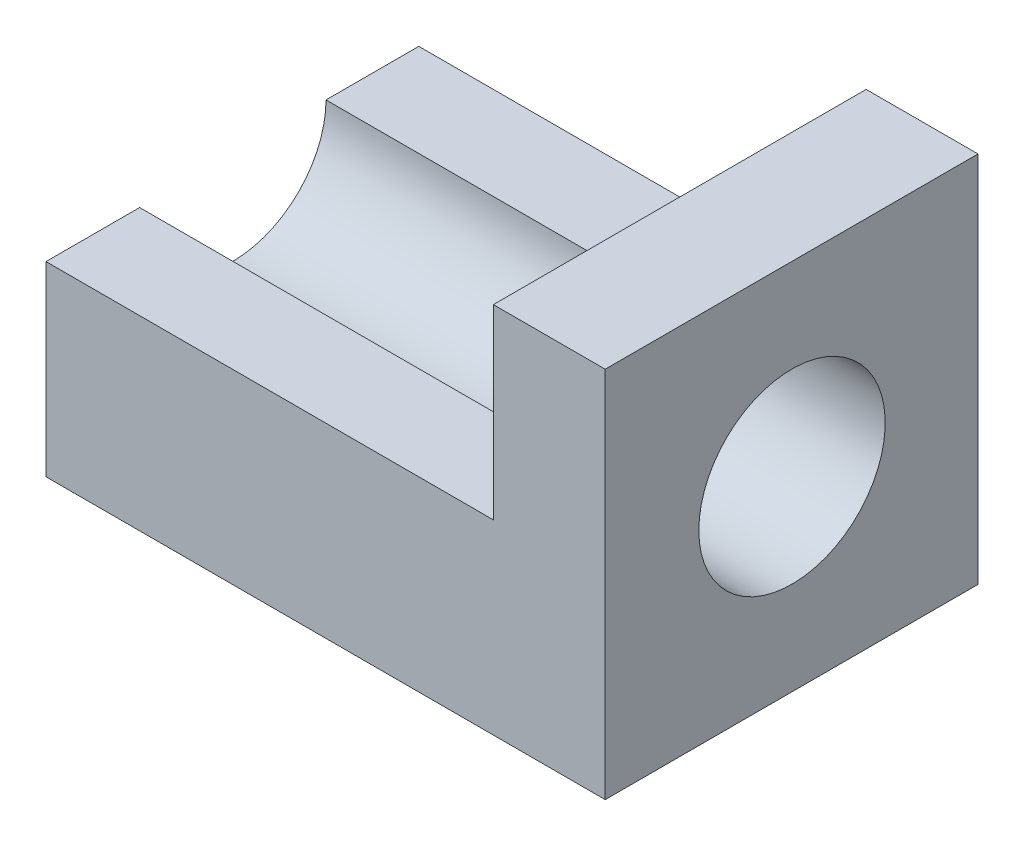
ISO-10303-21;
HEADER;
FILE_DESCRIPTION(('STEP AP214'),'2;1');
FILE_NAME('part.step','',(''),(''),'','','');
FILE_SCHEMA(('AUTOMOTIVE_DESIGN { 1 0 10303 214 1 1 1 1 }'));
ENDSEC;
DATA;
#1=APPLICATION_CONTEXT('core data for automotive mechanical design processes');
#2=APPLICATION_PROTOCOL_DEFINITION('international standard','automotive_design',2000,#1);
#3=PRODUCT_CONTEXT('',#1,'mechanical');
#4=PRODUCT('Part','Part','',(#3));
#5=PRODUCT_RELATED_PRODUCT_CATEGORY('part','',(#4));
#6=PRODUCT_DEFINITION_FORMATION('','',#4);
#7=PRODUCT_DEFINITION_CONTEXT('part definition',#1,'design');
#8=PRODUCT_DEFINITION('design','',#6,#7);
#9=PRODUCT_DEFINITION_SHAPE('','',#8);
#10=(LENGTH_UNIT() NAMED_UNIT(*) SI_UNIT(.MILLI.,.METRE.));
#11=(NAMED_UNIT(*) PLANE_ANGLE_UNIT() SI_UNIT($,.RADIAN.));
#12=(NAMED_UNIT(*) SI_UNIT($,.STERADIAN.) SOLID_ANGLE_UNIT());
#13=UNCERTAINTY_MEASURE_WITH_UNIT(LENGTH_MEASURE(1.E-05),#10,'distance_accuracy_value','');
#14=(GEOMETRIC_REPRESENTATION_CONTEXT(3) GLOBAL_UNCERTAINTY_ASSIGNED_CONTEXT((#13)) GLOBAL_UNIT_ASSIGNED_CONTEXT((#10,
#11,#12)) REPRESENTATION_CONTEXT('',''));
#15=CARTESIAN_POINT('',(0.,0.,0.));
#16=DIRECTION('',(0.,0.,1.));
#17=DIRECTION('',(1.,0.,0.));
#18=AXIS2_PLACEMENT_3D('',#15,#16,#17);
#19=CARTESIAN_POINT('',(150.,50.,-50.));
#20=DIRECTION('',(0.,-1.,0.));
#21=DIRECTION('',(0.,0.,-1.));
#22=AXIS2_PLACEMENT_3D('',#19,#20,#21);
#23=PLANE('',#22);
#24=DIRECTION('',(0.,0.,-1.));
#25=VECTOR('',#24,1.);
#26=CARTESIAN_POINT('',(120.,50.,-25.1109195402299));
#27=LINE('',#26,#25);
#28=CARTESIAN_POINT('',(120.,50.,-25.1109195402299));
#29=VERTEX_POINT('',#28);
#30=CARTESIAN_POINT('',(120.,50.,-50.));
#31=VERTEX_POINT('',#30);
#32=EDGE_CURVE('E133',#29,#31,#27,.T.);
#33=ORIENTED_EDGE('',*,*,#32,.T.);
#34=DIRECTION('',(-1.,0.,0.));
#35=VECTOR('',#34,1.);
#36=CARTESIAN_POINT('',(150.,50.,-50.));
#37=LINE('',#36,#35);
#38=CARTESIAN_POINT('',(0.,50.,-50.));
#39=VERTEX_POINT('',#38);
#40=EDGE_CURVE('E118',#31,#39,#37,.T.);
#41=ORIENTED_EDGE('',*,*,#40,.T.);
#42=DIRECTION('',(0.,0.,1.));
#43=VECTOR('',#42,1.);
#44=CARTESIAN_POINT('',(0.,50.,-50.));
#45=LINE('',#44,#43);
#46=CARTESIAN_POINT('',(0.,50.,-25.1109195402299));
#47=VERTEX_POINT('',#46);
#48=EDGE_CURVE('E111',#39,#47,#45,.T.);
#49=ORIENTED_EDGE('',*,*,#48,.T.);
#50=DIRECTION('',(-1.,0.,0.));
#51=VECTOR('',#50,1.);
#52=CARTESIAN_POINT('',(150.,50.,-25.1109195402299));
#53=LINE('',#52,#51);
#54=EDGE_CURVE('E116',#29,#47,#53,.T.);
#55=ORIENTED_EDGE('',*,*,#54,.F.);
#56=EDGE_LOOP('',(#33,#41,#49,#55));
#57=FACE_BOUND('',#56,.T.);
#58=ADVANCED_FACE('F31',(#57),#23,.F.);
#59=CARTESIAN_POINT('',(150.,50.,50.));
#60=DIRECTION('',(0.,-1.,0.));
#61=DIRECTION('',(0.,0.,-1.));
#62=AXIS2_PLACEMENT_3D('',#59,#60,#61);
#63=PLANE('',#62);
#64=DIRECTION('',(0.,0.,-1.));
#65=VECTOR('',#64,1.);
#66=CARTESIAN_POINT('',(120.,50.,50.));
#67=LINE('',#66,#65);
#68=CARTESIAN_POINT('',(120.,50.,50.));
#69=VERTEX_POINT('',#68);
#70=CARTESIAN_POINT('',(120.,50.,24.8890804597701));
#71=VERTEX_POINT('',#70);
#72=EDGE_CURVE('E201',#69,#71,#67,.T.);
#73=ORIENTED_EDGE('',*,*,#72,.T.);
#74=DIRECTION('',(-1.,0.,0.));
#75=VECTOR('',#74,1.);
#76=CARTESIAN_POINT('',(150.,50.,24.8890804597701));
#77=LINE('',#76,#75);
#78=CARTESIAN_POINT('',(0.,50.,24.8890804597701));
#79=VERTEX_POINT('',#78);
#80=EDGE_CURVE('E71',#71,#79,#77,.T.);
#81=ORIENTED_EDGE('',*,*,#80,.T.);
#82=DIRECTION('',(0.,0.,1.));
#83=VECTOR('',#82,1.);
#84=CARTESIAN_POINT('',(0.,50.,50.));
#85=LINE('',#84,#83);
#86=CARTESIAN_POINT('',(0.,50.,50.));
#87=VERTEX_POINT('',#86);
#88=EDGE_CURVE('E89',#79,#87,#85,.T.);
#89=ORIENTED_EDGE('',*,*,#88,.T.);
#90=DIRECTION('',(-1.,0.,0.));
#91=VECTOR('',#90,1.);
#92=CARTESIAN_POINT('',(150.,50.,50.));
#93=LINE('',#92,#91);
#94=EDGE_CURVE('E78',#69,#87,#93,.T.);
#95=ORIENTED_EDGE('',*,*,#94,.F.);
#96=EDGE_LOOP('',(#73,#81,#89,#95));
#97=FACE_BOUND('',#96,.T.);
#98=ADVANCED_FACE('F90',(#97),#63,.F.);
#99=CARTESIAN_POINT('',(150.,0.,50.));
#100=DIRECTION('',(0.,0.,-1.));
#101=DIRECTION('',(-1.,0.,0.));
#102=AXIS2_PLACEMENT_3D('',#99,#100,#101);
#103=PLANE('',#102);
#104=DIRECTION('',(0.,-1.,0.));
#105=VECTOR('',#104,1.);
#106=CARTESIAN_POINT('',(0.,0.,50.));
#107=LINE('',#106,#105);
#108=CARTESIAN_POINT('',(0.,0.,50.));
#109=VERTEX_POINT('',#108);
#110=EDGE_CURVE('E81',#87,#109,#107,.T.);
#111=ORIENTED_EDGE('',*,*,#110,.T.);
#112=DIRECTION('',(-1.,0.,0.));
#113=VECTOR('',#112,1.);
#114=CARTESIAN_POINT('',(150.,0.,50.));
#115=LINE('',#114,#113);
#116=CARTESIAN_POINT('',(150.,0.,50.));
#117=VERTEX_POINT('',#116);
#118=EDGE_CURVE('E11',#117,#109,#115,.T.);
#119=ORIENTED_EDGE('',*,*,#118,.F.);
#120=DIRECTION('',(0.,-1.,0.));
#121=VECTOR('',#120,1.);
#122=CARTESIAN_POINT('',(150.,0.,50.));
#123=LINE('',#122,#121);
#124=CARTESIAN_POINT('',(150.,100.,50.));
#125=VERTEX_POINT('',#124);
#126=EDGE_CURVE('E93',#125,#117,#123,.T.);
#127=ORIENTED_EDGE('',*,*,#126,.F.);
#128=DIRECTION('',(1.,0.,0.));
#129=VECTOR('',#128,1.);
#130=CARTESIAN_POINT('',(120.,100.,50.));
#131=LINE('',#130,#129);
#132=CARTESIAN_POINT('',(120.,100.,50.));
#133=VERTEX_POINT('',#132);
#134=EDGE_CURVE('E99',#133,#125,#131,.T.);
#135=ORIENTED_EDGE('',*,*,#134,.F.);
#136=DIRECTION('',(0.,-1.,0.));
#137=VECTOR('',#136,1.);
#138=CARTESIAN_POINT('',(120.,50.,50.));
#139=LINE('',#138,#137);
#140=EDGE_CURVE('E85',#133,#69,#139,.T.);
#141=ORIENTED_EDGE('',*,*,#140,.T.);
#142=ORIENTED_EDGE('',*,*,#94,.T.);
#143=EDGE_LOOP('',(#111,#119,#127,#135,#141,#142));
#144=FACE_BOUND('',#143,.T.);
#145=ADVANCED_FACE('F33',(#144),#103,.F.);
#146=CARTESIAN_POINT('',(150.,0.,50.));
#147=DIRECTION('',(0.,1.,0.));
#148=DIRECTION('',(0.,0.,1.));
#149=AXIS2_PLACEMENT_3D('',#146,#147,#148);
#150=PLANE('',#149);
#151=DIRECTION('',(0.,0.,-1.));
#152=VECTOR('',#151,1.);
#153=CARTESIAN_POINT('',(0.,0.,50.));
#154=LINE('',#153,#152);
#155=CARTESIAN_POINT('',(0.,0.,-50.));
#156=VERTEX_POINT('',#155);
#157=EDGE_CURVE('E98',#109,#156,#154,.T.);
#158=ORIENTED_EDGE('',*,*,#157,.T.);
#159=DIRECTION('',(-1.,0.,0.));
#160=VECTOR('',#159,1.);
#161=CARTESIAN_POINT('',(150.,0.,-50.));
#162=LINE('',#161,#160);
#163=CARTESIAN_POINT('',(150.,0.,-50.));
#164=VERTEX_POINT('',#163);
#165=EDGE_CURVE('E40',#164,#156,#162,.T.);
#166=ORIENTED_EDGE('',*,*,#165,.F.);
#167=DIRECTION('',(0.,0.,-1.));
#168=VECTOR('',#167,1.);
#169=CARTESIAN_POINT('',(150.,0.,50.));
#170=LINE('',#169,#168);
#171=EDGE_CURVE('E48',#117,#164,#170,.T.);
#172=ORIENTED_EDGE('',*,*,#171,.F.);
#173=ORIENTED_EDGE('',*,*,#118,.T.);
#174=EDGE_LOOP('',(#158,#166,#172,#173));
#175=FACE_BOUND('',#174,.T.);
#176=ADVANCED_FACE('F170',(#175),#150,.F.);
#177=CARTESIAN_POINT('',(150.,0.,-50.));
#178=DIRECTION('',(0.,0.,1.));
#179=DIRECTION('',(1.,0.,0.));
#180=AXIS2_PLACEMENT_3D('',#177,#178,#179);
#181=PLANE('',#180);
#182=DIRECTION('',(0.,1.,0.));
#183=VECTOR('',#182,1.);
#184=CARTESIAN_POINT('',(0.,0.,-50.));
#185=LINE('',#184,#183);
#186=EDGE_CURVE('E101',#156,#39,#185,.T.);
#187=ORIENTED_EDGE('',*,*,#186,.T.);
#188=ORIENTED_EDGE('',*,*,#40,.F.);
#189=DIRECTION('',(0.,1.,0.));
#190=VECTOR('',#189,1.);
#191=CARTESIAN_POINT('',(120.,50.,-50.));
#192=LINE('',#191,#190);
#193=CARTESIAN_POINT('',(120.,100.,-50.));
#194=VERTEX_POINT('',#193);
#195=EDGE_CURVE('E137',#31,#194,#192,.T.);
#196=ORIENTED_EDGE('',*,*,#195,.T.);
#197=DIRECTION('',(1.,0.,0.));
#198=VECTOR('',#197,1.);
#199=CARTESIAN_POINT('',(120.,100.,-50.));
#200=LINE('',#199,#198);
#201=CARTESIAN_POINT('',(150.,100.,-50.));
#202=VERTEX_POINT('',#201);
#203=EDGE_CURVE('E104',#194,#202,#200,.T.);
#204=ORIENTED_EDGE('',*,*,#203,.T.);
#205=DIRECTION('',(0.,1.,0.));
#206=VECTOR('',#205,1.);
#207=CARTESIAN_POINT('',(150.,0.,-50.));
#208=LINE('',#207,#206);
#209=EDGE_CURVE('E126',#164,#202,#208,.T.);
#210=ORIENTED_EDGE('',*,*,#209,.F.);
#211=ORIENTED_EDGE('',*,*,#165,.T.);
#212=EDGE_LOOP('',(#187,#188,#196,#204,#210,#211));
#213=FACE_BOUND('',#212,.T.);
#214=ADVANCED_FACE('F122',(#213),#181,.F.);
#215=CARTESIAN_POINT('',(150.,50.,-0.110919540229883));
#216=DIRECTION('',(-1.,0.,0.));
#217=DIRECTION('',(0.,0.,1.));
#218=AXIS2_PLACEMENT_3D('',#215,#216,#217);
#219=CYLINDRICAL_SURFACE('',#218,25.);
#220=CARTESIAN_POINT('',(120.,50.,-0.110919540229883));
#221=DIRECTION('',(-1.,0.,0.));
#222=DIRECTION('',(0.,0.,-1.));
#223=AXIS2_PLACEMENT_3D('',#220,#221,#222);
#224=CIRCLE('',#223,25.);
#225=EDGE_CURVE('E161',#71,#29,#224,.T.);
#226=ORIENTED_EDGE('',*,*,#225,.T.);
#227=ORIENTED_EDGE('',*,*,#54,.T.);
#228=CARTESIAN_POINT('',(0.,50.,-0.110919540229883));
#229=DIRECTION('',(-1.,0.,0.));
#230=DIRECTION('',(0.,0.,1.));
#231=AXIS2_PLACEMENT_3D('',#228,#229,#230);
#232=CIRCLE('',#231,25.);
#233=EDGE_CURVE('E94',#47,#79,#232,.T.);
#234=ORIENTED_EDGE('',*,*,#233,.T.);
#235=ORIENTED_EDGE('',*,*,#80,.F.);
#236=EDGE_LOOP('',(#226,#227,#234,#235));
#237=FACE_BOUND('',#236,.T.);
#238=CARTESIAN_POINT('',(150.,50.,-0.110919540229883));
#239=DIRECTION('',(-1.,0.,0.));
#240=DIRECTION('',(0.,0.,1.));
#241=AXIS2_PLACEMENT_3D('',#238,#239,#240);
#242=CIRCLE('',#241,25.);
#243=CARTESIAN_POINT('',(150.,50.,24.8890804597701));
#244=VERTEX_POINT('',#243);
#245=EDGE_CURVE('E86',#244,#244,#242,.T.);
#246=ORIENTED_EDGE('',*,*,#245,.F.);
#247=EDGE_LOOP('',(#246));
#248=FACE_BOUND('',#247,.T.);
#249=ADVANCED_FACE('F176',(#237,#248),#219,.F.);
#250=CARTESIAN_POINT('',(150.,50.,-0.110919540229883));
#251=DIRECTION('',(-1.,0.,0.));
#252=DIRECTION('',(0.,0.,1.));
#253=AXIS2_PLACEMENT_3D('',#250,#251,#252);
#254=PLANE('',#253);
#255=ORIENTED_EDGE('',*,*,#245,.T.);
#256=EDGE_LOOP('',(#255));
#257=FACE_BOUND('',#256,.T.);
#258=ORIENTED_EDGE('',*,*,#126,.T.);
#259=ORIENTED_EDGE('',*,*,#171,.T.);
#260=ORIENTED_EDGE('',*,*,#209,.T.);
#261=DIRECTION('',(0.,0.,1.));
#262=VECTOR('',#261,1.);
#263=CARTESIAN_POINT('',(150.,100.,50.));
#264=LINE('',#263,#262);
#265=EDGE_CURVE('E158',#202,#125,#264,.T.);
#266=ORIENTED_EDGE('',*,*,#265,.T.);
#267=EDGE_LOOP('',(#258,#259,#260,#266));
#268=FACE_BOUND('',#267,.T.);
#269=ADVANCED_FACE('F156',(#257,#268),#254,.F.);
#270=CARTESIAN_POINT('',(0.,50.,-0.110919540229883));
#271=DIRECTION('',(-1.,0.,0.));
#272=DIRECTION('',(0.,0.,1.));
#273=AXIS2_PLACEMENT_3D('',#270,#271,#272);
#274=PLANE('',#273);
#275=ORIENTED_EDGE('',*,*,#110,.F.);
#276=ORIENTED_EDGE('',*,*,#88,.F.);
#277=ORIENTED_EDGE('',*,*,#233,.F.);
#278=ORIENTED_EDGE('',*,*,#48,.F.);
#279=ORIENTED_EDGE('',*,*,#186,.F.);
#280=ORIENTED_EDGE('',*,*,#157,.F.);
#281=EDGE_LOOP('',(#275,#276,#277,#278,#279,#280));
#282=FACE_BOUND('',#281,.T.);
#283=ADVANCED_FACE('F96',(#282),#274,.T.);
#284=CARTESIAN_POINT('',(120.,100.,50.));
#285=DIRECTION('',(0.,1.,0.));
#286=DIRECTION('',(0.,0.,1.));
#287=AXIS2_PLACEMENT_3D('',#284,#285,#286);
#288=PLANE('',#287);
#289=ORIENTED_EDGE('',*,*,#265,.F.);
#290=ORIENTED_EDGE('',*,*,#203,.F.);
#291=DIRECTION('',(0.,0.,1.));
#292=VECTOR('',#291,1.);
#293=CARTESIAN_POINT('',(120.,100.,50.));
#294=LINE('',#293,#292);
#295=EDGE_CURVE('E202',#194,#133,#294,.T.);
#296=ORIENTED_EDGE('',*,*,#295,.T.);
#297=ORIENTED_EDGE('',*,*,#134,.T.);
#298=EDGE_LOOP('',(#289,#290,#296,#297));
#299=FACE_BOUND('',#298,.T.);
#300=ADVANCED_FACE('F163',(#299),#288,.T.);
#301=CARTESIAN_POINT('',(120.,50.,-0.110919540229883));
#302=DIRECTION('',(1.,0.,0.));
#303=DIRECTION('',(0.,0.,-1.));
#304=AXIS2_PLACEMENT_3D('',#301,#302,#303);
#305=PLANE('',#304);
#306=ORIENTED_EDGE('',*,*,#32,.F.);
#307=ORIENTED_EDGE('',*,*,#225,.F.);
#308=ORIENTED_EDGE('',*,*,#72,.F.);
#309=ORIENTED_EDGE('',*,*,#140,.F.);
#310=ORIENTED_EDGE('',*,*,#295,.F.);
#311=ORIENTED_EDGE('',*,*,#195,.F.);
#312=EDGE_LOOP('',(#306,#307,#308,#309,#310,#311));
#313=FACE_BOUND('',#312,.T.);
#314=ADVANCED_FACE('F195',(#313),#305,.F.);
#315=CLOSED_SHELL('',(#58,#98,#145,#176,#214,#249,#269,#283,#300,#314));
#316=MANIFOLD_SOLID_BREP('B2',#315);
#317=ADVANCED_BREP_SHAPE_REPRESENTATION('',(#18,#316),#14);
#318=SHAPE_DEFINITION_REPRESENTATION(#9,#317);
ENDSEC;
END-ISO-10303-21;
